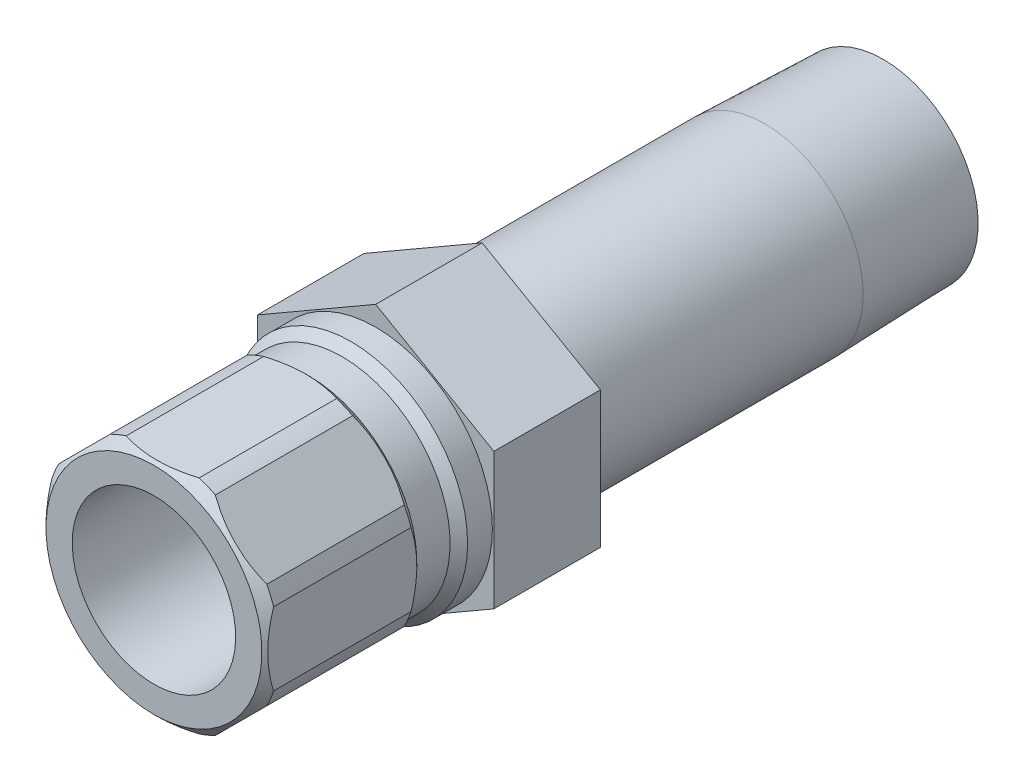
from build123d import *

# Parameters (mm, degrees)
SKETCH2_R           = 6.2611
BOSS_EXTRUDE1_DEPTH = 9.271
CUT_EXTRUDE1_START  = 5.8166
SKETCH3_OUTSIDE_W   = 36.744
SKETCH3_OUTSIDE_H   = 39.926
CUT_EXTRUDE1_DEPTH  = 42.089745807


with BuildPart() as part:
    # Sketch1 → Revolve1 (revolve)
    with BuildSketch(Plane(origin=(0, 0, 0), x_dir=(0, 0, -1), z_dir=(1, 0, 0))):
        Polygon((-19.304, 7.112), (-19.304, 9.398), (-18.542, 10.16), (-6.5786, 10.16), (-5.8166, 9.398), (-2.921, 9.398), (-2.159, 10.16), (0, 10.16), (0, 8.5725), (33.8582, 8.5725), (44.196, 8.249445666), (44.196, 6.2611), (-0.6731, 6.2611), (-1.524, 7.112), align=None)
    revolve(axis=Axis((0, 0, 0), (0, 0, 1)))

    # Sketch2 → Boss-Extrude1 (add)
    with BuildSketch(Plane.XY):
        Polygon((-10.287, 5.939202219), (-10.287, -5.939202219), (0, -11.878404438), (10.287, -5.939202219), (10.287, 5.939202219), (0, 11.878404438), align=None)
        with Locations(Location((0, 0, 0), (0, 0, 90))):
            Circle(SKETCH2_R, mode=Mode.SUBTRACT)
    extrude(amount=-BOSS_EXTRUDE1_DEPTH)

    # Sketch3 outside → Cut-Extrude1 (cut, through all)
    with BuildSketch(Plane.XY.offset(CUT_EXTRUDE1_START)):
        Rectangle(SKETCH3_OUTSIDE_W, SKETCH3_OUTSIDE_H)
        Polygon((9.652, -3.997989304), (9.652, 3.997989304), (3.997989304, 9.652), (-3.997989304, 9.652), (-9.652, 3.997989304), (-9.652, -3.997989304), (-3.997989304, -9.652), (3.997989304, -9.652), align=None, mode=Mode.SUBTRACT)
    extrude(amount=CUT_EXTRUDE1_DEPTH, mode=Mode.SUBTRACT)


solid = part.part
